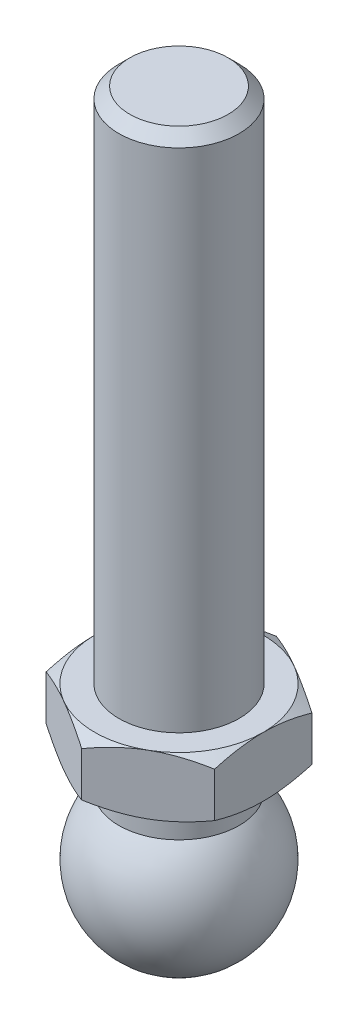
ISO-10303-21;
HEADER;
FILE_DESCRIPTION(('STEP AP214'),'2;1');
FILE_NAME('part.step','',(''),(''),'','','');
FILE_SCHEMA(('AUTOMOTIVE_DESIGN { 1 0 10303 214 1 1 1 1 }'));
ENDSEC;
DATA;
#1=APPLICATION_CONTEXT('core data for automotive mechanical design processes');
#2=APPLICATION_PROTOCOL_DEFINITION('international standard','automotive_design',2000,#1);
#3=PRODUCT_CONTEXT('',#1,'mechanical');
#4=PRODUCT('Part','Part','',(#3));
#5=PRODUCT_RELATED_PRODUCT_CATEGORY('part','',(#4));
#6=PRODUCT_DEFINITION_FORMATION('','',#4);
#7=PRODUCT_DEFINITION_CONTEXT('part definition',#1,'design');
#8=PRODUCT_DEFINITION('design','',#6,#7);
#9=PRODUCT_DEFINITION_SHAPE('','',#8);
#10=(LENGTH_UNIT() NAMED_UNIT(*) SI_UNIT(.MILLI.,.METRE.));
#11=(NAMED_UNIT(*) PLANE_ANGLE_UNIT() SI_UNIT($,.RADIAN.));
#12=(NAMED_UNIT(*) SI_UNIT($,.STERADIAN.) SOLID_ANGLE_UNIT());
#13=UNCERTAINTY_MEASURE_WITH_UNIT(LENGTH_MEASURE(1.E-05),#10,'distance_accuracy_value','');
#14=(GEOMETRIC_REPRESENTATION_CONTEXT(3) GLOBAL_UNCERTAINTY_ASSIGNED_CONTEXT((#13)) GLOBAL_UNIT_ASSIGNED_CONTEXT((#10,
#11,#12)) REPRESENTATION_CONTEXT('',''));
#15=CARTESIAN_POINT('',(0.,0.,0.));
#16=DIRECTION('',(0.,0.,1.));
#17=DIRECTION('',(1.,0.,0.));
#18=AXIS2_PLACEMENT_3D('',#15,#16,#17);
#19=CARTESIAN_POINT('',(0.,12.6,0.));
#20=DIRECTION('',(0.,-1.,0.));
#21=DIRECTION('',(0.,0.,-1.));
#22=AXIS2_PLACEMENT_3D('',#19,#20,#21);
#23=CONICAL_SURFACE('',#22,7.,1.0471975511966);
#24=CARTESIAN_POINT('',(-7.,8.53828268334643,12.1648696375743));
#25=CARTESIAN_POINT('',(-7.,8.68391573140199,11.8738003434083));
#26=CARTESIAN_POINT('',(-7.,8.82854589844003,11.5822239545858));
#27=CARTESIAN_POINT('',(-7.,9.11531569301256,10.997825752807));
#28=CARTESIAN_POINT('',(-7.,9.25745515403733,10.7050038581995));
#29=CARTESIAN_POINT('',(-7.,9.53902214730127,10.117331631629));
#30=CARTESIAN_POINT('',(-7.,9.67844364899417,9.8224784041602));
#31=CARTESIAN_POINT('',(-7.,9.95360604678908,9.23106328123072));
#32=CARTESIAN_POINT('',(-7.,10.0893470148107,8.93450141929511));
#33=CARTESIAN_POINT('',(-7.,10.3623110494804,8.32593520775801));
#34=CARTESIAN_POINT('',(-7.,10.4993254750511,8.0138369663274));
#35=CARTESIAN_POINT('',(-7.,10.7671383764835,7.38695797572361));
#36=CARTESIAN_POINT('',(-7.,10.8979365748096,7.07217710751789));
#37=CARTESIAN_POINT('',(-7.,11.1515530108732,6.43962449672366));
#38=CARTESIAN_POINT('',(-7.,11.274376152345,6.12185473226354));
#39=CARTESIAN_POINT('',(-7.,11.5099016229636,5.4826031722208));
#40=CARTESIAN_POINT('',(-7.,11.6226050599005,5.16112178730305));
#41=CARTESIAN_POINT('',(-7.,11.8599014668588,4.43821731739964));
#42=CARTESIAN_POINT('',(-7.,11.981118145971,4.03566892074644));
#43=CARTESIAN_POINT('',(-7.,12.1969740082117,3.22331060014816));
#44=CARTESIAN_POINT('',(-7.,12.2916155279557,2.81350131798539));
#45=CARTESIAN_POINT('',(-7.,12.4069999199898,2.1974256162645));
#46=CARTESIAN_POINT('',(-7.,12.4408518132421,1.99359214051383));
#47=CARTESIAN_POINT('',(-7.,12.4993191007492,1.58461613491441));
#48=CARTESIAN_POINT('',(-7.,12.5239358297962,1.37947379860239));
#49=CARTESIAN_POINT('',(-7.,12.5631968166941,0.968289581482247));
#50=CARTESIAN_POINT('',(-7.,12.5778439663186,0.762247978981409));
#51=CARTESIAN_POINT('',(-7.,12.5967021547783,0.349683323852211));
#52=CARTESIAN_POINT('',(-7.,12.6009132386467,0.143160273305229));
#53=CARTESIAN_POINT('',(-7.,12.5987493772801,-0.271082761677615));
#54=CARTESIAN_POINT('',(-7.,12.5923100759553,-0.47880240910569));
#55=CARTESIAN_POINT('',(-7.,12.5689433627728,-0.893645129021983));
#56=CARTESIAN_POINT('',(-7.,12.5520159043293,-1.10076819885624));
#57=CARTESIAN_POINT('',(-7.,12.5082124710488,-1.5140304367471));
#58=CARTESIAN_POINT('',(-7.,12.4813327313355,-1.72016920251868));
#59=CARTESIAN_POINT('',(-7.,12.4184180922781,-2.13103319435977));
#60=CARTESIAN_POINT('',(-7.,12.3823828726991,-2.33575837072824));
#61=CARTESIAN_POINT('',(-7.,12.2605686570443,-2.95437912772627));
#62=CARTESIAN_POINT('',(-7.,12.1618729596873,-3.36575077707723));
#63=CARTESIAN_POINT('',(-7.,11.9384533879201,-4.18138012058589));
#64=CARTESIAN_POINT('',(-7.,11.8137148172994,-4.58563365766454));
#65=CARTESIAN_POINT('',(-7.,11.5733248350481,-5.30320893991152));
#66=CARTESIAN_POINT('',(-7.,11.4612875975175,-5.6177595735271));
#67=CARTESIAN_POINT('',(-7.,11.2278514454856,-6.24325021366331));
#68=CARTESIAN_POINT('',(-7.,11.1064551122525,-6.55419118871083));
#69=CARTESIAN_POINT('',(-7.,10.8562070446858,-7.17328528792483));
#70=CARTESIAN_POINT('',(-7.,10.7273503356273,-7.48143638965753));
#71=CARTESIAN_POINT('',(-7.,10.4637823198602,-8.09523802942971));
#72=CARTESIAN_POINT('',(-7.,10.3290706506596,-8.40088841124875));
#73=CARTESIAN_POINT('',(-7.,10.0607840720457,-8.99716345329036));
#74=CARTESIAN_POINT('',(-7.,9.92740317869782,-9.2878756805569));
#75=CARTESIAN_POINT('',(-7.,9.65714715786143,-9.86766295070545));
#76=CARTESIAN_POINT('',(-7.,9.52027208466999,-10.1567380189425));
#77=CARTESIAN_POINT('',(-7.,9.24389786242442,-10.7329937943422));
#78=CARTESIAN_POINT('',(-7.,9.10440383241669,-11.0201769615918));
#79=CARTESIAN_POINT('',(-7.,8.82302286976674,-11.5933594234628));
#80=CARTESIAN_POINT('',(-7.,8.68113600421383,-11.879358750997));
#81=CARTESIAN_POINT('',(-7.,8.53828268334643,-12.1648696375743));
#82=B_SPLINE_CURVE_WITH_KNOTS('',3,(#24,#25,#26,#27,#28,#29,#30,#31,#32,#33,#34,#35,#36,#37,#38,
#39,#40,#41,#42,#43,#44,#45,#46,#47,#48,#49,#50,#51,#52,#53,#54,#55,#56,#57,#58,#59,#60,#61,#62,
#63,#64,#65,#66,#67,#68,#69,#70,#71,#72,#73,#74,#75,#76,#77,#78,#79,#80,#81),.UNSPECIFIED.,.F.,
.F.,(4,2,2,2,2,2,2,2,2,2,2,2,2,2,2,2,2,2,2,2,2,2,2,2,2,2,2,2,4),(0.,0.976413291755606,
1.95289161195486,2.93133423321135,3.90975772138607,4.93225217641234,5.95479223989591,
6.97669748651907,7.99849072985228,9.25906449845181,10.5195273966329,11.1392271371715,
11.7588372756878,12.3782676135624,12.9976952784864,13.6208795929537,14.2440666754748,
14.8674897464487,15.490934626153,16.7587972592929,18.027377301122,19.0289263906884,
20.0302002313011,21.0321496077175,22.0341611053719,22.9936838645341,23.9531917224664,
24.9109871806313,25.8687558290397),.UNSPECIFIED.);
#83=CARTESIAN_POINT('',(-7.,11.9747852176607,4.04145188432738));
#84=VERTEX_POINT('',#83);
#85=CARTESIAN_POINT('',(-7.,12.6,0.));
#86=VERTEX_POINT('',#85);
#87=EDGE_CURVE('E309',#84,#86,#82,.T.);
#88=ORIENTED_EDGE('',*,*,#87,.F.);
#89=CARTESIAN_POINT('',(0.0002,11.9747185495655,8.0830192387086));
#90=CARTESIAN_POINT('',(-0.153667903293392,12.0260001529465,7.99418356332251));
#91=CARTESIAN_POINT('',(-0.30810950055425,12.0749544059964,7.90501666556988));
#92=CARTESIAN_POINT('',(-0.618246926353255,12.1675672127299,7.72595873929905));
#93=CARTESIAN_POINT('',(-0.773943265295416,12.2112234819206,7.63606741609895));
#94=CARTESIAN_POINT('',(-1.24352516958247,12.3333884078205,7.36495417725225));
#95=CARTESIAN_POINT('',(-1.5592643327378,12.402874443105,7.18266208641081));
#96=CARTESIAN_POINT('',(-2.03176224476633,12.4843550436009,6.9098652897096));
#97=CARTESIAN_POINT('',(-2.18710922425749,12.5075665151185,6.82017566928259));
#98=CARTESIAN_POINT('',(-2.49850511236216,12.5464887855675,6.64039116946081));
#99=CARTESIAN_POINT('',(-2.65455395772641,12.5622002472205,6.55029632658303));
#100=CARTESIAN_POINT('',(-2.96692267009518,12.5857220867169,6.36995016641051));
#101=CARTESIAN_POINT('',(-3.12324202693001,12.5935414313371,6.27969914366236));
#102=CARTESIAN_POINT('',(-3.43601650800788,12.6011197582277,6.09911871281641));
#103=CARTESIAN_POINT('',(-3.59247162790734,12.600878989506,6.00878930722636));
#104=CARTESIAN_POINT('',(-4.02110687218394,12.5891402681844,5.76131663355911));
#105=CARTESIAN_POINT('',(-4.2931466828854,12.5694342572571,5.60425437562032));
#106=CARTESIAN_POINT('',(-4.8354194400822,12.5069465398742,5.29117305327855));
#107=CARTESIAN_POINT('',(-5.10565047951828,12.464143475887,5.13515508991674));
#108=CARTESIAN_POINT('',(-5.64901454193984,12.3571483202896,4.82144370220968));
#109=CARTESIAN_POINT('',(-5.92207900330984,12.2925029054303,4.66378986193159));
#110=CARTESIAN_POINT('',(-6.46413578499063,12.145783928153,4.35083323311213));
#111=CARTESIAN_POINT('',(-6.73313504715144,12.0637448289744,4.19552643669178));
#112=CARTESIAN_POINT('',(-7.0002,11.9747185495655,4.04133641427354));
#113=B_SPLINE_CURVE_WITH_KNOTS('',3,(#89,#90,#91,#92,#93,#94,#95,#96,#97,#98,#99,#100,#101,#102,
#103,#104,#105,#106,#107,#108,#109,#110,#111,#112),.UNSPECIFIED.,.F.,.F.,(4,2,2,2,2,2,2,2,2,2,2,
4),(0.,0.554727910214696,1.10969417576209,2.2219327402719,2.76443041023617,3.30688013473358,
3.8487128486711,4.3905288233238,5.33376515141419,6.27787517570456,7.2429241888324,
8.20607866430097),.UNSPECIFIED.);
#114=CARTESIAN_POINT('',(-3.5,12.6,6.06217782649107));
#115=VERTEX_POINT('',#114);
#116=EDGE_CURVE('E135',#115,#84,#113,.T.);
#117=ORIENTED_EDGE('',*,*,#116,.F.);
#118=CARTESIAN_POINT('',(0.,12.6,0.));
#119=DIRECTION('',(0.,-1.,0.));
#120=DIRECTION('',(0.,0.,-1.));
#121=AXIS2_PLACEMENT_3D('',#118,#119,#120);
#122=CIRCLE('',#121,7.);
#123=EDGE_CURVE('E283',#115,#86,#122,.T.);
#124=ORIENTED_EDGE('',*,*,#123,.T.);
#125=EDGE_LOOP('',(#88,#117,#124));
#126=FACE_BOUND('',#125,.T.);
#127=ADVANCED_FACE('F14',(#126),#23,.T.);
#128=CARTESIAN_POINT('',(-7.,11.9747852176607,-4.04145188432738));
#129=VERTEX_POINT('',#128);
#130=EDGE_CURVE('E193',#86,#129,#82,.T.);
#131=ORIENTED_EDGE('',*,*,#130,.F.);
#132=CARTESIAN_POINT('',(-3.5,12.6,-6.06217782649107));
#133=VERTEX_POINT('',#132);
#134=EDGE_CURVE('E195',#86,#133,#122,.T.);
#135=ORIENTED_EDGE('',*,*,#134,.T.);
#136=CARTESIAN_POINT('',(-7.0002,11.9747185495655,-4.04133641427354));
#137=CARTESIAN_POINT('',(-6.84633209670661,12.0260001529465,-4.13017208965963));
#138=CARTESIAN_POINT('',(-6.69189049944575,12.0749544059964,-4.21933898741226));
#139=CARTESIAN_POINT('',(-6.38175307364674,12.1675672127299,-4.39839691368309));
#140=CARTESIAN_POINT('',(-6.22605673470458,12.2112234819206,-4.48828823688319));
#141=CARTESIAN_POINT('',(-5.75647483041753,12.3333884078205,-4.75940147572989));
#142=CARTESIAN_POINT('',(-5.4407356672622,12.402874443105,-4.94169356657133));
#143=CARTESIAN_POINT('',(-4.96823775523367,12.4843550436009,-5.21449036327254));
#144=CARTESIAN_POINT('',(-4.81289077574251,12.5075665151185,-5.30417998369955));
#145=CARTESIAN_POINT('',(-4.50149488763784,12.5464887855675,-5.48396448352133));
#146=CARTESIAN_POINT('',(-4.34544604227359,12.5622002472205,-5.57405932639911));
#147=CARTESIAN_POINT('',(-4.03307732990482,12.5857220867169,-5.75440548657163));
#148=CARTESIAN_POINT('',(-3.87675797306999,12.5935414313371,-5.84465650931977));
#149=CARTESIAN_POINT('',(-3.56398349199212,12.6011197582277,-6.02523694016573));
#150=CARTESIAN_POINT('',(-3.40752837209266,12.600878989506,-6.11556634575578));
#151=CARTESIAN_POINT('',(-2.97889312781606,12.5891402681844,-6.36303901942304));
#152=CARTESIAN_POINT('',(-2.7068533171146,12.5694342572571,-6.52010127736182));
#153=CARTESIAN_POINT('',(-2.1645805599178,12.5069465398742,-6.83318259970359));
#154=CARTESIAN_POINT('',(-1.89434952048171,12.464143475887,-6.9892005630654));
#155=CARTESIAN_POINT('',(-1.35098545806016,12.3571483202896,-7.30291195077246));
#156=CARTESIAN_POINT('',(-1.07792099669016,12.2925029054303,-7.46056579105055));
#157=CARTESIAN_POINT('',(-0.535864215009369,12.145783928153,-7.77352241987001));
#158=CARTESIAN_POINT('',(-0.266864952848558,12.0637448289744,-7.92882921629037));
#159=CARTESIAN_POINT('',(0.000200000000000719,11.9747185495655,-8.0830192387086));
#160=B_SPLINE_CURVE_WITH_KNOTS('',3,(#136,#137,#138,#139,#140,#141,#142,#143,#144,#145,#146,
#147,#148,#149,#150,#151,#152,#153,#154,#155,#156,#157,#158,#159),.UNSPECIFIED.,.F.,.F.,(4,2,2,
2,2,2,2,2,2,2,2,4),(0.,0.554727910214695,1.10969417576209,2.2219327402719,2.76443041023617,
3.30688013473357,3.8487128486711,4.39052882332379,5.33376515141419,6.27787517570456,
7.2429241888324,8.20607866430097),.UNSPECIFIED.);
#161=EDGE_CURVE('E183',#129,#133,#160,.T.);
#162=ORIENTED_EDGE('',*,*,#161,.F.);
#163=EDGE_LOOP('',(#131,#135,#162));
#164=FACE_BOUND('',#163,.T.);
#165=ADVANCED_FACE('F192',(#164),#23,.T.);
#166=CARTESIAN_POINT('',(0.,11.9747852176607,-8.08290376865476));
#167=VERTEX_POINT('',#166);
#168=EDGE_CURVE('E197',#133,#167,#160,.T.);
#169=ORIENTED_EDGE('',*,*,#168,.F.);
#170=CARTESIAN_POINT('',(3.5,12.6,-6.06217782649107));
#171=VERTEX_POINT('',#170);
#172=EDGE_CURVE('E293',#133,#171,#122,.T.);
#173=ORIENTED_EDGE('',*,*,#172,.T.);
#174=CARTESIAN_POINT('',(-0.0002,11.9747185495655,-8.0830192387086));
#175=CARTESIAN_POINT('',(0.153667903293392,12.0260001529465,-7.99418356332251));
#176=CARTESIAN_POINT('',(0.30810950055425,12.0749544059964,-7.90501666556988));
#177=CARTESIAN_POINT('',(0.618246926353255,12.1675672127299,-7.72595873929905));
#178=CARTESIAN_POINT('',(0.773943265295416,12.2112234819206,-7.63606741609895));
#179=CARTESIAN_POINT('',(1.24352516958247,12.3333884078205,-7.36495417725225));
#180=CARTESIAN_POINT('',(1.5592643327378,12.402874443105,-7.18266208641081));
#181=CARTESIAN_POINT('',(2.03176224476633,12.4843550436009,-6.9098652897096));
#182=CARTESIAN_POINT('',(2.18710922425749,12.5075665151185,-6.82017566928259));
#183=CARTESIAN_POINT('',(2.49850511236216,12.5464887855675,-6.64039116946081));
#184=CARTESIAN_POINT('',(2.65455395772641,12.5622002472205,-6.55029632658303));
#185=CARTESIAN_POINT('',(2.96692267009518,12.5857220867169,-6.36995016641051));
#186=CARTESIAN_POINT('',(3.12324202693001,12.5935414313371,-6.27969914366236));
#187=CARTESIAN_POINT('',(3.43601650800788,12.6011197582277,-6.09911871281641));
#188=CARTESIAN_POINT('',(3.59247162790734,12.600878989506,-6.00878930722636));
#189=CARTESIAN_POINT('',(4.02110687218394,12.5891402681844,-5.76131663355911));
#190=CARTESIAN_POINT('',(4.2931466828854,12.5694342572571,-5.60425437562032));
#191=CARTESIAN_POINT('',(4.8354194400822,12.5069465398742,-5.29117305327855));
#192=CARTESIAN_POINT('',(5.10565047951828,12.464143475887,-5.13515508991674));
#193=CARTESIAN_POINT('',(5.64901454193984,12.3571483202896,-4.82144370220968));
#194=CARTESIAN_POINT('',(5.92207900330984,12.2925029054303,-4.66378986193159));
#195=CARTESIAN_POINT('',(6.46413578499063,12.145783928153,-4.35083323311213));
#196=CARTESIAN_POINT('',(6.73313504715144,12.0637448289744,-4.19552643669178));
#197=CARTESIAN_POINT('',(7.0002,11.9747185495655,-4.04133641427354));
#198=B_SPLINE_CURVE_WITH_KNOTS('',3,(#174,#175,#176,#177,#178,#179,#180,#181,#182,#183,#184,
#185,#186,#187,#188,#189,#190,#191,#192,#193,#194,#195,#196,#197),.UNSPECIFIED.,.F.,.F.,(4,2,2,
2,2,2,2,2,2,2,2,4),(0.,0.554727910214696,1.10969417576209,2.2219327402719,2.76443041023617,
3.30688013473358,3.8487128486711,4.3905288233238,5.33376515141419,6.27787517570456,
7.2429241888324,8.20607866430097),.UNSPECIFIED.);
#199=EDGE_CURVE('E243',#167,#171,#198,.T.);
#200=ORIENTED_EDGE('',*,*,#199,.F.);
#201=EDGE_LOOP('',(#169,#173,#200));
#202=FACE_BOUND('',#201,.T.);
#203=ADVANCED_FACE('F342',(#202),#23,.T.);
#204=CARTESIAN_POINT('',(7.,11.9747852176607,-4.04145188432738));
#205=VERTEX_POINT('',#204);
#206=EDGE_CURVE('E238',#171,#205,#198,.T.);
#207=ORIENTED_EDGE('',*,*,#206,.F.);
#208=CARTESIAN_POINT('',(7.,12.6,0.));
#209=VERTEX_POINT('',#208);
#210=EDGE_CURVE('E288',#171,#209,#122,.T.);
#211=ORIENTED_EDGE('',*,*,#210,.T.);
#212=CARTESIAN_POINT('',(7.,8.53828268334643,-12.1648696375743));
#213=CARTESIAN_POINT('',(7.,8.68391573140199,-11.8738003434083));
#214=CARTESIAN_POINT('',(7.,8.82854589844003,-11.5822239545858));
#215=CARTESIAN_POINT('',(7.,9.11531569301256,-10.997825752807));
#216=CARTESIAN_POINT('',(7.,9.25745515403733,-10.7050038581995));
#217=CARTESIAN_POINT('',(7.,9.53902214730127,-10.117331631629));
#218=CARTESIAN_POINT('',(7.,9.67844364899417,-9.8224784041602));
#219=CARTESIAN_POINT('',(7.,9.95360604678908,-9.23106328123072));
#220=CARTESIAN_POINT('',(7.,10.0893470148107,-8.93450141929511));
#221=CARTESIAN_POINT('',(7.,10.3623110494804,-8.32593520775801));
#222=CARTESIAN_POINT('',(7.,10.4993254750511,-8.0138369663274));
#223=CARTESIAN_POINT('',(7.,10.7671383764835,-7.38695797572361));
#224=CARTESIAN_POINT('',(7.,10.8979365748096,-7.07217710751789));
#225=CARTESIAN_POINT('',(7.,11.1515530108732,-6.43962449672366));
#226=CARTESIAN_POINT('',(7.,11.274376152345,-6.12185473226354));
#227=CARTESIAN_POINT('',(7.,11.5099016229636,-5.4826031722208));
#228=CARTESIAN_POINT('',(7.,11.6226050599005,-5.16112178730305));
#229=CARTESIAN_POINT('',(7.,11.8599014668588,-4.43821731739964));
#230=CARTESIAN_POINT('',(7.,11.981118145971,-4.03566892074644));
#231=CARTESIAN_POINT('',(7.,12.1969740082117,-3.22331060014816));
#232=CARTESIAN_POINT('',(7.,12.2916155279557,-2.81350131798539));
#233=CARTESIAN_POINT('',(7.,12.4069999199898,-2.1974256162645));
#234=CARTESIAN_POINT('',(7.,12.4408518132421,-1.99359214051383));
#235=CARTESIAN_POINT('',(7.,12.4993191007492,-1.58461613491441));
#236=CARTESIAN_POINT('',(7.,12.5239358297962,-1.37947379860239));
#237=CARTESIAN_POINT('',(7.,12.5631968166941,-0.968289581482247));
#238=CARTESIAN_POINT('',(7.,12.5778439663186,-0.762247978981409));
#239=CARTESIAN_POINT('',(7.,12.5967021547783,-0.349683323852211));
#240=CARTESIAN_POINT('',(7.,12.6009132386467,-0.143160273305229));
#241=CARTESIAN_POINT('',(7.,12.5987493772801,0.271082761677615));
#242=CARTESIAN_POINT('',(7.,12.5923100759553,0.47880240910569));
#243=CARTESIAN_POINT('',(7.,12.5689433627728,0.893645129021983));
#244=CARTESIAN_POINT('',(7.,12.5520159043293,1.10076819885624));
#245=CARTESIAN_POINT('',(7.,12.5082124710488,1.5140304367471));
#246=CARTESIAN_POINT('',(7.,12.4813327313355,1.72016920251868));
#247=CARTESIAN_POINT('',(7.,12.4184180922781,2.13103319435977));
#248=CARTESIAN_POINT('',(7.,12.3823828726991,2.33575837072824));
#249=CARTESIAN_POINT('',(7.,12.2605686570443,2.95437912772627));
#250=CARTESIAN_POINT('',(7.,12.1618729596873,3.36575077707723));
#251=CARTESIAN_POINT('',(7.,11.9384533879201,4.18138012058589));
#252=CARTESIAN_POINT('',(7.,11.8137148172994,4.58563365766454));
#253=CARTESIAN_POINT('',(7.,11.5733248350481,5.30320893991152));
#254=CARTESIAN_POINT('',(7.,11.4612875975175,5.6177595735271));
#255=CARTESIAN_POINT('',(7.,11.2278514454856,6.24325021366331));
#256=CARTESIAN_POINT('',(7.,11.1064551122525,6.55419118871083));
#257=CARTESIAN_POINT('',(7.,10.8562070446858,7.17328528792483));
#258=CARTESIAN_POINT('',(7.,10.7273503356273,7.48143638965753));
#259=CARTESIAN_POINT('',(7.,10.4637823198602,8.09523802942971));
#260=CARTESIAN_POINT('',(7.,10.3290706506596,8.40088841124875));
#261=CARTESIAN_POINT('',(7.,10.0607840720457,8.99716345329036));
#262=CARTESIAN_POINT('',(7.,9.92740317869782,9.2878756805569));
#263=CARTESIAN_POINT('',(7.,9.65714715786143,9.86766295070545));
#264=CARTESIAN_POINT('',(7.,9.52027208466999,10.1567380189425));
#265=CARTESIAN_POINT('',(7.,9.24389786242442,10.7329937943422));
#266=CARTESIAN_POINT('',(7.,9.10440383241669,11.0201769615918));
#267=CARTESIAN_POINT('',(7.,8.82302286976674,11.5933594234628));
#268=CARTESIAN_POINT('',(7.,8.68113600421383,11.879358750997));
#269=CARTESIAN_POINT('',(7.,8.53828268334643,12.1648696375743));
#270=B_SPLINE_CURVE_WITH_KNOTS('',3,(#212,#213,#214,#215,#216,#217,#218,#219,#220,#221,#222,
#223,#224,#225,#226,#227,#228,#229,#230,#231,#232,#233,#234,#235,#236,#237,#238,#239,#240,#241,
#242,#243,#244,#245,#246,#247,#248,#249,#250,#251,#252,#253,#254,#255,#256,#257,#258,#259,#260,
#261,#262,#263,#264,#265,#266,#267,#268,#269),.UNSPECIFIED.,.F.,.F.,(4,2,2,2,2,2,2,2,2,2,2,2,2,
2,2,2,2,2,2,2,2,2,2,2,2,2,2,2,4),(0.,0.976413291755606,1.95289161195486,2.93133423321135,
3.90975772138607,4.93225217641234,5.95479223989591,6.97669748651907,7.99849072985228,
9.25906449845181,10.5195273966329,11.1392271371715,11.7588372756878,12.3782676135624,
12.9976952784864,13.6208795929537,14.2440666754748,14.8674897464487,15.490934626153,
16.7587972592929,18.027377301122,19.0289263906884,20.0302002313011,21.0321496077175,
22.0341611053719,22.9936838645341,23.9531917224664,24.9109871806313,25.8687558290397),.UNSPECIFIED.);
#271=EDGE_CURVE('E249',#205,#209,#270,.T.);
#272=ORIENTED_EDGE('',*,*,#271,.F.);
#273=EDGE_LOOP('',(#207,#211,#272));
#274=FACE_BOUND('',#273,.T.);
#275=ADVANCED_FACE('F352',(#274),#23,.T.);
#276=CARTESIAN_POINT('',(7.,11.9747852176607,4.04145188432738));
#277=VERTEX_POINT('',#276);
#278=EDGE_CURVE('E251',#209,#277,#270,.T.);
#279=ORIENTED_EDGE('',*,*,#278,.F.);
#280=CARTESIAN_POINT('',(3.5,12.6,6.06217782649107));
#281=VERTEX_POINT('',#280);
#282=EDGE_CURVE('E281',#209,#281,#122,.T.);
#283=ORIENTED_EDGE('',*,*,#282,.T.);
#284=CARTESIAN_POINT('',(7.0002,11.9747185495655,4.04133641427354));
#285=CARTESIAN_POINT('',(6.84633209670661,12.0260001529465,4.13017208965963));
#286=CARTESIAN_POINT('',(6.69189049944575,12.0749544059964,4.21933898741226));
#287=CARTESIAN_POINT('',(6.38175307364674,12.1675672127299,4.39839691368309));
#288=CARTESIAN_POINT('',(6.22605673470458,12.2112234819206,4.48828823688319));
#289=CARTESIAN_POINT('',(5.75647483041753,12.3333884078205,4.75940147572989));
#290=CARTESIAN_POINT('',(5.4407356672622,12.402874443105,4.94169356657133));
#291=CARTESIAN_POINT('',(4.96823775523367,12.4843550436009,5.21449036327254));
#292=CARTESIAN_POINT('',(4.81289077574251,12.5075665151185,5.30417998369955));
#293=CARTESIAN_POINT('',(4.50149488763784,12.5464887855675,5.48396448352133));
#294=CARTESIAN_POINT('',(4.34544604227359,12.5622002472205,5.57405932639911));
#295=CARTESIAN_POINT('',(4.03307732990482,12.5857220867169,5.75440548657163));
#296=CARTESIAN_POINT('',(3.87675797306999,12.5935414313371,5.84465650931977));
#297=CARTESIAN_POINT('',(3.56398349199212,12.6011197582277,6.02523694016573));
#298=CARTESIAN_POINT('',(3.40752837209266,12.600878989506,6.11556634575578));
#299=CARTESIAN_POINT('',(2.97889312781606,12.5891402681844,6.36303901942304));
#300=CARTESIAN_POINT('',(2.7068533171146,12.5694342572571,6.52010127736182));
#301=CARTESIAN_POINT('',(2.1645805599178,12.5069465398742,6.83318259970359));
#302=CARTESIAN_POINT('',(1.89434952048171,12.464143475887,6.9892005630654));
#303=CARTESIAN_POINT('',(1.35098545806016,12.3571483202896,7.30291195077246));
#304=CARTESIAN_POINT('',(1.07792099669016,12.2925029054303,7.46056579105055));
#305=CARTESIAN_POINT('',(0.535864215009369,12.145783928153,7.77352241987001));
#306=CARTESIAN_POINT('',(0.266864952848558,12.0637448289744,7.92882921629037));
#307=CARTESIAN_POINT('',(-0.000200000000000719,11.9747185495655,8.0830192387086));
#308=B_SPLINE_CURVE_WITH_KNOTS('',3,(#284,#285,#286,#287,#288,#289,#290,#291,#292,#293,#294,
#295,#296,#297,#298,#299,#300,#301,#302,#303,#304,#305,#306,#307),.UNSPECIFIED.,.F.,.F.,(4,2,2,
2,2,2,2,2,2,2,2,4),(0.,0.554727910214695,1.10969417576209,2.2219327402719,2.76443041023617,
3.30688013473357,3.8487128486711,4.39052882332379,5.33376515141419,6.27787517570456,
7.2429241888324,8.20607866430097),.UNSPECIFIED.);
#309=EDGE_CURVE('E126',#277,#281,#308,.T.);
#310=ORIENTED_EDGE('',*,*,#309,.F.);
#311=EDGE_LOOP('',(#279,#283,#310));
#312=FACE_BOUND('',#311,.T.);
#313=ADVANCED_FACE('F285',(#312),#23,.T.);
#314=CARTESIAN_POINT('',(0.,11.9747852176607,8.08290376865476));
#315=VERTEX_POINT('',#314);
#316=EDGE_CURVE('E116',#281,#315,#308,.T.);
#317=ORIENTED_EDGE('',*,*,#316,.F.);
#318=EDGE_CURVE('E274',#281,#115,#122,.T.);
#319=ORIENTED_EDGE('',*,*,#318,.T.);
#320=EDGE_CURVE('E29',#315,#115,#113,.T.);
#321=ORIENTED_EDGE('',*,*,#320,.F.);
#322=EDGE_LOOP('',(#317,#319,#321));
#323=FACE_BOUND('',#322,.T.);
#324=ADVANCED_FACE('F273',(#323),#23,.T.);
#325=CARTESIAN_POINT('',(0.,55.6,0.));
#326=DIRECTION('',(0.,-1.,0.));
#327=DIRECTION('',(0.,0.,-1.));
#328=AXIS2_PLACEMENT_3D('',#325,#326,#327);
#329=PLANE('',#328);
#330=CARTESIAN_POINT('',(0.,55.6,0.));
#331=DIRECTION('',(0.,-1.,0.));
#332=DIRECTION('',(0.,0.,-1.));
#333=AXIS2_PLACEMENT_3D('',#330,#331,#332);
#334=CIRCLE('',#333,4.08);
#335=CARTESIAN_POINT('',(0.,55.6,-4.08));
#336=VERTEX_POINT('',#335);
#337=EDGE_CURVE('E22',#336,#336,#334,.T.);
#338=ORIENTED_EDGE('',*,*,#337,.F.);
#339=EDGE_LOOP('',(#338));
#340=FACE_BOUND('',#339,.T.);
#341=ADVANCED_FACE('F16',(#340),#329,.F.);
#342=CARTESIAN_POINT('',(0.,55.6,0.));
#343=DIRECTION('',(0.,-1.,0.));
#344=DIRECTION('',(0.,0.,-1.));
#345=AXIS2_PLACEMENT_3D('',#342,#343,#344);
#346=CONICAL_SURFACE('',#345,4.08,0.785398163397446);
#347=CARTESIAN_POINT('',(0.,54.68,0.));
#348=DIRECTION('',(0.,-1.,0.));
#349=DIRECTION('',(0.,0.,-1.));
#350=AXIS2_PLACEMENT_3D('',#347,#348,#349);
#351=CIRCLE('',#350,5.);
#352=CARTESIAN_POINT('',(0.,54.68,-5.));
#353=VERTEX_POINT('',#352);
#354=EDGE_CURVE('E290',#353,#353,#351,.T.);
#355=ORIENTED_EDGE('',*,*,#354,.F.);
#356=EDGE_LOOP('',(#355));
#357=FACE_BOUND('',#356,.T.);
#358=ORIENTED_EDGE('',*,*,#337,.T.);
#359=EDGE_LOOP('',(#358));
#360=FACE_BOUND('',#359,.T.);
#361=ADVANCED_FACE('F350',(#357,#360),#346,.T.);
#362=CARTESIAN_POINT('',(0.,-7.,0.));
#363=DIRECTION('',(0.,-1.,0.));
#364=DIRECTION('',(0.,0.,-1.));
#365=AXIS2_PLACEMENT_3D('',#362,#363,#364);
#366=CYLINDRICAL_SURFACE('',#365,5.);
#367=CARTESIAN_POINT('',(0.,12.6,0.));
#368=DIRECTION('',(0.,-1.,0.));
#369=DIRECTION('',(0.,0.,-1.));
#370=AXIS2_PLACEMENT_3D('',#367,#368,#369);
#371=CIRCLE('',#370,5.);
#372=CARTESIAN_POINT('',(0.,12.6,-5.));
#373=VERTEX_POINT('',#372);
#374=EDGE_CURVE('E287',#373,#373,#371,.T.);
#375=ORIENTED_EDGE('',*,*,#374,.F.);
#376=EDGE_LOOP('',(#375));
#377=FACE_BOUND('',#376,.T.);
#378=ORIENTED_EDGE('',*,*,#354,.T.);
#379=EDGE_LOOP('',(#378));
#380=FACE_BOUND('',#379,.T.);
#381=ADVANCED_FACE('F427',(#377,#380),#366,.T.);
#382=CARTESIAN_POINT('',(5.,12.6,0.));
#383=DIRECTION('',(0.,-1.,0.));
#384=DIRECTION('',(0.,0.,-1.));
#385=AXIS2_PLACEMENT_3D('',#382,#383,#384);
#386=PLANE('',#385);
#387=ORIENTED_EDGE('',*,*,#282,.F.);
#388=ORIENTED_EDGE('',*,*,#210,.F.);
#389=ORIENTED_EDGE('',*,*,#172,.F.);
#390=ORIENTED_EDGE('',*,*,#134,.F.);
#391=ORIENTED_EDGE('',*,*,#123,.F.);
#392=ORIENTED_EDGE('',*,*,#318,.F.);
#393=EDGE_LOOP('',(#387,#388,#389,#390,#391,#392));
#394=FACE_BOUND('',#393,.T.);
#395=ORIENTED_EDGE('',*,*,#374,.T.);
#396=EDGE_LOOP('',(#395));
#397=FACE_BOUND('',#396,.T.);
#398=ADVANCED_FACE('F278',(#394,#397),#386,.F.);
#399=CARTESIAN_POINT('',(-7.,7.65,-4.04145188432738));
#400=DIRECTION('',(-1.,0.,0.));
#401=DIRECTION('',(0.,0.,1.));
#402=AXIS2_PLACEMENT_3D('',#399,#400,#401);
#403=PLANE('',#402);
#404=ORIENTED_EDGE('',*,*,#87,.T.);
#405=ORIENTED_EDGE('',*,*,#130,.T.);
#406=DIRECTION('',(0.,1.,0.));
#407=VECTOR('',#406,1.);
#408=CARTESIAN_POINT('',(-7.,7.65,-4.04145188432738));
#409=LINE('',#408,#407);
#410=CARTESIAN_POINT('',(-7.,8.27521478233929,-4.04145188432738));
#411=VERTEX_POINT('',#410);
#412=EDGE_CURVE('E109',#411,#129,#409,.T.);
#413=ORIENTED_EDGE('',*,*,#412,.F.);
#414=CARTESIAN_POINT('',(-7.,11.7117173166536,-12.1648696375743));
#415=CARTESIAN_POINT('',(-7.,11.566084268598,-11.8738003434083));
#416=CARTESIAN_POINT('',(-7.,11.42145410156,-11.5822239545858));
#417=CARTESIAN_POINT('',(-7.,11.1346843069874,-10.997825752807));
#418=CARTESIAN_POINT('',(-7.,10.9925448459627,-10.7050038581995));
#419=CARTESIAN_POINT('',(-7.,10.7109778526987,-10.1173316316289));
#420=CARTESIAN_POINT('',(-7.,10.5715563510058,-9.82247840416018));
#421=CARTESIAN_POINT('',(-7.,10.2963939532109,-9.2310632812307));
#422=CARTESIAN_POINT('',(-7.,10.1606529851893,-8.93450141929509));
#423=CARTESIAN_POINT('',(-7.,9.88768895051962,-8.32593520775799));
#424=CARTESIAN_POINT('',(-7.,9.75067452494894,-8.01383696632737));
#425=CARTESIAN_POINT('',(-7.,9.48286162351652,-7.38695797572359));
#426=CARTESIAN_POINT('',(-7.,9.3520634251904,-7.07217710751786));
#427=CARTESIAN_POINT('',(-7.,9.09844698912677,-6.43962449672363));
#428=CARTESIAN_POINT('',(-7.,8.97562384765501,-6.12185473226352));
#429=CARTESIAN_POINT('',(-7.,8.7400983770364,-5.48260317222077));
#430=CARTESIAN_POINT('',(-7.,8.62739494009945,-5.16112178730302));
#431=CARTESIAN_POINT('',(-7.,8.39009853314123,-4.43821731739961));
#432=CARTESIAN_POINT('',(-7.,8.26888185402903,-4.0356689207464));
#433=CARTESIAN_POINT('',(-7.,8.05302599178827,-3.22331060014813));
#434=CARTESIAN_POINT('',(-7.,7.95838447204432,-2.81350131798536));
#435=CARTESIAN_POINT('',(-7.,7.84300008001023,-2.19742561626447));
#436=CARTESIAN_POINT('',(-7.,7.80914818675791,-1.9935921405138));
#437=CARTESIAN_POINT('',(-7.,7.75068089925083,-1.58461613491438));
#438=CARTESIAN_POINT('',(-7.,7.7260641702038,-1.37947379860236));
#439=CARTESIAN_POINT('',(-7.,7.68680318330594,-0.968289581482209));
#440=CARTESIAN_POINT('',(-7.,7.67215603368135,-0.762247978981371));
#441=CARTESIAN_POINT('',(-7.,7.65329784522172,-0.349683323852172));
#442=CARTESIAN_POINT('',(-7.,7.64908676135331,-0.14316027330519));
#443=CARTESIAN_POINT('',(-7.,7.65125062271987,0.271082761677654));
#444=CARTESIAN_POINT('',(-7.,7.65768992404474,0.478802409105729));
#445=CARTESIAN_POINT('',(-7.,7.68105663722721,0.893645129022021));
#446=CARTESIAN_POINT('',(-7.,7.69798409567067,1.10076819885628));
#447=CARTESIAN_POINT('',(-7.,7.74178752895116,1.51403043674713));
#448=CARTESIAN_POINT('',(-7.,7.76866726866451,1.72016920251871));
#449=CARTESIAN_POINT('',(-7.,7.83158190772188,2.13103319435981));
#450=CARTESIAN_POINT('',(-7.,7.86761712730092,2.33575837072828));
#451=CARTESIAN_POINT('',(-7.,7.98943134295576,2.95437912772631));
#452=CARTESIAN_POINT('',(-7.,8.08812704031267,3.36575077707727));
#453=CARTESIAN_POINT('',(-7.,8.31154661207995,4.18138012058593));
#454=CARTESIAN_POINT('',(-7.,8.43628518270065,4.58563365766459));
#455=CARTESIAN_POINT('',(-7.,8.67667516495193,5.30320893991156));
#456=CARTESIAN_POINT('',(-7.,8.78871240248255,5.61775957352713));
#457=CARTESIAN_POINT('',(-7.,9.02214855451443,6.24325021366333));
#458=CARTESIAN_POINT('',(-7.,9.14354488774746,6.55419118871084));
#459=CARTESIAN_POINT('',(-7.,9.39379295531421,7.17328528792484));
#460=CARTESIAN_POINT('',(-7.,9.52264966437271,7.48143638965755));
#461=CARTESIAN_POINT('',(-7.,9.78621768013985,8.09523802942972));
#462=CARTESIAN_POINT('',(-7.,9.92092934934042,8.40088841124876));
#463=CARTESIAN_POINT('',(-7.,10.1892159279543,8.99716345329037));
#464=CARTESIAN_POINT('',(-7.,10.3225968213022,9.28787568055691));
#465=CARTESIAN_POINT('',(-7.,10.5928528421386,9.86766295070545));
#466=CARTESIAN_POINT('',(-7.,10.72972791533,10.1567380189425));
#467=CARTESIAN_POINT('',(-7.,11.0061021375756,10.7329937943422));
#468=CARTESIAN_POINT('',(-7.,11.1455961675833,11.0201769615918));
#469=CARTESIAN_POINT('',(-7.,11.4269771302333,11.5933594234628));
#470=CARTESIAN_POINT('',(-7.,11.5688639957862,11.879358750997));
#471=CARTESIAN_POINT('',(-7.,11.7117173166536,12.1648696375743));
#472=B_SPLINE_CURVE_WITH_KNOTS('',3,(#414,#415,#416,#417,#418,#419,#420,#421,#422,#423,#424,
#425,#426,#427,#428,#429,#430,#431,#432,#433,#434,#435,#436,#437,#438,#439,#440,#441,#442,#443,
#444,#445,#446,#447,#448,#449,#450,#451,#452,#453,#454,#455,#456,#457,#458,#459,#460,#461,#462,
#463,#464,#465,#466,#467,#468,#469,#470,#471),.UNSPECIFIED.,.F.,.F.,(4,2,2,2,2,2,2,2,2,2,2,2,2,
2,2,2,2,2,2,2,2,2,2,2,2,2,2,2,4),(0.,0.976413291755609,1.95289161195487,2.93133423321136,
3.90975772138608,4.93225217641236,5.95479223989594,6.9766974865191,7.99849072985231,
9.25906449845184,10.5195273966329,11.1392271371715,11.7588372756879,12.3782676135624,
12.9976952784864,13.6208795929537,14.2440666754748,14.8674897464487,15.490934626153,
16.758797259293,18.027377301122,19.0289263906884,20.0302002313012,21.0321496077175,
22.0341611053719,22.9936838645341,23.9531917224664,24.9109871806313,25.8687558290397),.UNSPECIFIED.);
#473=CARTESIAN_POINT('',(-7.,7.65,0.));
#474=VERTEX_POINT('',#473);
#475=EDGE_CURVE('E199',#411,#474,#472,.T.);
#476=ORIENTED_EDGE('',*,*,#475,.T.);
#477=CARTESIAN_POINT('',(-7.,8.27521478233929,4.04145188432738));
#478=VERTEX_POINT('',#477);
#479=EDGE_CURVE('E196',#474,#478,#472,.T.);
#480=ORIENTED_EDGE('',*,*,#479,.T.);
#481=DIRECTION('',(0.,1.,0.));
#482=VECTOR('',#481,1.);
#483=CARTESIAN_POINT('',(-7.,7.65,4.04145188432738));
#484=LINE('',#483,#482);
#485=EDGE_CURVE('E118',#478,#84,#484,.T.);
#486=ORIENTED_EDGE('',*,*,#485,.T.);
#487=EDGE_LOOP('',(#404,#405,#413,#476,#480,#486));
#488=FACE_BOUND('',#487,.T.);
#489=ADVANCED_FACE('F224',(#488),#403,.T.);
#490=CARTESIAN_POINT('',(0.,7.65,-8.08290376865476));
#491=DIRECTION('',(-0.5,0.,-0.866025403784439));
#492=DIRECTION('',(-0.866025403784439,0.,0.5));
#493=AXIS2_PLACEMENT_3D('',#490,#491,#492);
#494=PLANE('',#493);
#495=ORIENTED_EDGE('',*,*,#161,.T.);
#496=ORIENTED_EDGE('',*,*,#168,.T.);
#497=DIRECTION('',(0.,1.,0.));
#498=VECTOR('',#497,1.);
#499=CARTESIAN_POINT('',(0.,7.65,-8.08290376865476));
#500=LINE('',#499,#498);
#501=CARTESIAN_POINT('',(0.,8.27521478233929,-8.08290376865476));
#502=VERTEX_POINT('',#501);
#503=EDGE_CURVE('E175',#502,#167,#500,.T.);
#504=ORIENTED_EDGE('',*,*,#503,.F.);
#505=CARTESIAN_POINT('',(0.0002,8.2752814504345,-8.0830192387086));
#506=CARTESIAN_POINT('',(-0.153667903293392,8.22399984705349,-7.99418356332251));
#507=CARTESIAN_POINT('',(-0.30810950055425,8.17504559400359,-7.90501666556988));
#508=CARTESIAN_POINT('',(-0.618246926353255,8.08243278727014,-7.72595873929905));
#509=CARTESIAN_POINT('',(-0.773943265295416,8.03877651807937,-7.63606741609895));
#510=CARTESIAN_POINT('',(-1.24352516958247,7.9166115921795,-7.36495417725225));
#511=CARTESIAN_POINT('',(-1.5592643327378,7.84712555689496,-7.18266208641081));
#512=CARTESIAN_POINT('',(-2.03176224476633,7.7656449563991,-6.9098652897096));
#513=CARTESIAN_POINT('',(-2.18710922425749,7.74243348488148,-6.82017566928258));
#514=CARTESIAN_POINT('',(-2.49850511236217,7.70351121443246,-6.64039116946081));
#515=CARTESIAN_POINT('',(-2.65455395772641,7.68779975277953,-6.55029632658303));
#516=CARTESIAN_POINT('',(-2.96692267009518,7.66427791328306,-6.36995016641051));
#517=CARTESIAN_POINT('',(-3.12324202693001,7.65645856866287,-6.27969914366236));
#518=CARTESIAN_POINT('',(-3.43601650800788,7.64888024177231,-6.09911871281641));
#519=CARTESIAN_POINT('',(-3.59247162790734,7.64912101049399,-6.00878930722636));
#520=CARTESIAN_POINT('',(-4.02110687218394,7.6608597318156,-5.76131663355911));
#521=CARTESIAN_POINT('',(-4.2931466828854,7.68056574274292,-5.60425437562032));
#522=CARTESIAN_POINT('',(-4.8354194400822,7.74305346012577,-5.29117305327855));
#523=CARTESIAN_POINT('',(-5.10565047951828,7.78585652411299,-5.13515508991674));
#524=CARTESIAN_POINT('',(-5.64901454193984,7.89285167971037,-4.82144370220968));
#525=CARTESIAN_POINT('',(-5.92207900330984,7.95749709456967,-4.66378986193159));
#526=CARTESIAN_POINT('',(-6.46413578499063,8.10421607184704,-4.35083323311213));
#527=CARTESIAN_POINT('',(-6.73313504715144,8.18625517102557,-4.19552643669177));
#528=CARTESIAN_POINT('',(-7.0002,8.2752814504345,-4.04133641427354));
#529=B_SPLINE_CURVE_WITH_KNOTS('',3,(#505,#506,#507,#508,#509,#510,#511,#512,#513,#514,#515,
#516,#517,#518,#519,#520,#521,#522,#523,#524,#525,#526,#527,#528),.UNSPECIFIED.,.F.,.F.,(4,2,2,
2,2,2,2,2,2,2,2,4),(0.,0.554727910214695,1.10969417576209,2.2219327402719,2.76443041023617,
3.30688013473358,3.8487128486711,4.39052882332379,5.33376515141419,6.27787517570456,
7.2429241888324,8.20607866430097),.UNSPECIFIED.);
#530=CARTESIAN_POINT('',(-3.5,7.65,-6.06217782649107));
#531=VERTEX_POINT('',#530);
#532=EDGE_CURVE('E201',#502,#531,#529,.T.);
#533=ORIENTED_EDGE('',*,*,#532,.T.);
#534=EDGE_CURVE('E186',#531,#411,#529,.T.);
#535=ORIENTED_EDGE('',*,*,#534,.T.);
#536=ORIENTED_EDGE('',*,*,#412,.T.);
#537=EDGE_LOOP('',(#495,#496,#504,#533,#535,#536));
#538=FACE_BOUND('',#537,.T.);
#539=ADVANCED_FACE('F182',(#538),#494,.T.);
#540=CARTESIAN_POINT('',(7.,7.65,-4.04145188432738));
#541=DIRECTION('',(0.5,0.,-0.866025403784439));
#542=DIRECTION('',(-0.866025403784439,0.,-0.5));
#543=AXIS2_PLACEMENT_3D('',#540,#541,#542);
#544=PLANE('',#543);
#545=ORIENTED_EDGE('',*,*,#199,.T.);
#546=ORIENTED_EDGE('',*,*,#206,.T.);
#547=DIRECTION('',(0.,1.,0.));
#548=VECTOR('',#547,1.);
#549=CARTESIAN_POINT('',(7.,7.65,-4.04145188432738));
#550=LINE('',#549,#548);
#551=CARTESIAN_POINT('',(7.,8.27521478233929,-4.04145188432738));
#552=VERTEX_POINT('',#551);
#553=EDGE_CURVE('E172',#552,#205,#550,.T.);
#554=ORIENTED_EDGE('',*,*,#553,.F.);
#555=CARTESIAN_POINT('',(7.0002,8.2752814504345,-4.04133641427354));
#556=CARTESIAN_POINT('',(6.84633209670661,8.22399984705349,-4.13017208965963));
#557=CARTESIAN_POINT('',(6.69189049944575,8.17504559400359,-4.21933898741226));
#558=CARTESIAN_POINT('',(6.38175307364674,8.08243278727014,-4.39839691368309));
#559=CARTESIAN_POINT('',(6.22605673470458,8.03877651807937,-4.48828823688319));
#560=CARTESIAN_POINT('',(5.75647483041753,7.9166115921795,-4.75940147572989));
#561=CARTESIAN_POINT('',(5.4407356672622,7.84712555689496,-4.94169356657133));
#562=CARTESIAN_POINT('',(4.96823775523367,7.7656449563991,-5.21449036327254));
#563=CARTESIAN_POINT('',(4.81289077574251,7.74243348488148,-5.30417998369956));
#564=CARTESIAN_POINT('',(4.50149488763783,7.70351121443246,-5.48396448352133));
#565=CARTESIAN_POINT('',(4.34544604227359,7.68779975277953,-5.57405932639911));
#566=CARTESIAN_POINT('',(4.03307732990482,7.66427791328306,-5.75440548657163));
#567=CARTESIAN_POINT('',(3.87675797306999,7.65645856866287,-5.84465650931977));
#568=CARTESIAN_POINT('',(3.56398349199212,7.64888024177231,-6.02523694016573));
#569=CARTESIAN_POINT('',(3.40752837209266,7.64912101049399,-6.11556634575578));
#570=CARTESIAN_POINT('',(2.97889312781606,7.6608597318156,-6.36303901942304));
#571=CARTESIAN_POINT('',(2.7068533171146,7.68056574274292,-6.52010127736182));
#572=CARTESIAN_POINT('',(2.1645805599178,7.74305346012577,-6.83318259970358));
#573=CARTESIAN_POINT('',(1.89434952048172,7.78585652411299,-6.9892005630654));
#574=CARTESIAN_POINT('',(1.35098545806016,7.89285167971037,-7.30291195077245));
#575=CARTESIAN_POINT('',(1.07792099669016,7.95749709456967,-7.46056579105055));
#576=CARTESIAN_POINT('',(0.53586421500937,8.10421607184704,-7.77352241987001));
#577=CARTESIAN_POINT('',(0.266864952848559,8.18625517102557,-7.92882921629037));
#578=CARTESIAN_POINT('',(-0.000199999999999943,8.2752814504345,-8.0830192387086));
#579=B_SPLINE_CURVE_WITH_KNOTS('',3,(#555,#556,#557,#558,#559,#560,#561,#562,#563,#564,#565,
#566,#567,#568,#569,#570,#571,#572,#573,#574,#575,#576,#577,#578),.UNSPECIFIED.,.F.,.F.,(4,2,2,
2,2,2,2,2,2,2,2,4),(0.,0.554727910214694,1.10969417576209,2.2219327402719,2.76443041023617,
3.30688013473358,3.8487128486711,4.39052882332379,5.33376515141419,6.27787517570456,
7.2429241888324,8.20607866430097),.UNSPECIFIED.);
#580=CARTESIAN_POINT('',(3.5,7.65,-6.06217782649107));
#581=VERTEX_POINT('',#580);
#582=EDGE_CURVE('E244',#552,#581,#579,.T.);
#583=ORIENTED_EDGE('',*,*,#582,.T.);
#584=EDGE_CURVE('E232',#581,#502,#579,.T.);
#585=ORIENTED_EDGE('',*,*,#584,.T.);
#586=ORIENTED_EDGE('',*,*,#503,.T.);
#587=EDGE_LOOP('',(#545,#546,#554,#583,#585,#586));
#588=FACE_BOUND('',#587,.T.);
#589=ADVANCED_FACE('F223',(#588),#544,.T.);
#590=CARTESIAN_POINT('',(7.,7.65,4.04145188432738));
#591=DIRECTION('',(1.,0.,0.));
#592=DIRECTION('',(0.,0.,-1.));
#593=AXIS2_PLACEMENT_3D('',#590,#591,#592);
#594=PLANE('',#593);
#595=ORIENTED_EDGE('',*,*,#271,.T.);
#596=ORIENTED_EDGE('',*,*,#278,.T.);
#597=DIRECTION('',(0.,1.,0.));
#598=VECTOR('',#597,1.);
#599=CARTESIAN_POINT('',(7.,7.65,4.04145188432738));
#600=LINE('',#599,#598);
#601=CARTESIAN_POINT('',(7.,8.27521478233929,4.04145188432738));
#602=VERTEX_POINT('',#601);
#603=EDGE_CURVE('E117',#602,#277,#600,.T.);
#604=ORIENTED_EDGE('',*,*,#603,.F.);
#605=CARTESIAN_POINT('',(7.,11.7117173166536,12.1648696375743));
#606=CARTESIAN_POINT('',(7.,11.566084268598,11.8738003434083));
#607=CARTESIAN_POINT('',(7.,11.42145410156,11.5822239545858));
#608=CARTESIAN_POINT('',(7.,11.1346843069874,10.997825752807));
#609=CARTESIAN_POINT('',(7.,10.9925448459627,10.7050038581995));
#610=CARTESIAN_POINT('',(7.,10.7109778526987,10.1173316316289));
#611=CARTESIAN_POINT('',(7.,10.5715563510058,9.82247840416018));
#612=CARTESIAN_POINT('',(7.,10.2963939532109,9.2310632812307));
#613=CARTESIAN_POINT('',(7.,10.1606529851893,8.93450141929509));
#614=CARTESIAN_POINT('',(7.,9.88768895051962,8.32593520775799));
#615=CARTESIAN_POINT('',(7.,9.75067452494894,8.01383696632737));
#616=CARTESIAN_POINT('',(7.,9.48286162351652,7.38695797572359));
#617=CARTESIAN_POINT('',(7.,9.3520634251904,7.07217710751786));
#618=CARTESIAN_POINT('',(7.,9.09844698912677,6.43962449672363));
#619=CARTESIAN_POINT('',(7.,8.97562384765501,6.12185473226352));
#620=CARTESIAN_POINT('',(7.,8.7400983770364,5.48260317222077));
#621=CARTESIAN_POINT('',(7.,8.62739494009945,5.16112178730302));
#622=CARTESIAN_POINT('',(7.,8.39009853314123,4.43821731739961));
#623=CARTESIAN_POINT('',(7.,8.26888185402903,4.0356689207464));
#624=CARTESIAN_POINT('',(7.,8.05302599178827,3.22331060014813));
#625=CARTESIAN_POINT('',(7.,7.95838447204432,2.81350131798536));
#626=CARTESIAN_POINT('',(7.,7.84300008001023,2.19742561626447));
#627=CARTESIAN_POINT('',(7.,7.80914818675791,1.9935921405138));
#628=CARTESIAN_POINT('',(7.,7.75068089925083,1.58461613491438));
#629=CARTESIAN_POINT('',(7.,7.7260641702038,1.37947379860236));
#630=CARTESIAN_POINT('',(7.,7.68680318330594,0.968289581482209));
#631=CARTESIAN_POINT('',(7.,7.67215603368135,0.762247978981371));
#632=CARTESIAN_POINT('',(7.,7.65329784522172,0.349683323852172));
#633=CARTESIAN_POINT('',(7.,7.64908676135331,0.14316027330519));
#634=CARTESIAN_POINT('',(7.,7.65125062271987,-0.271082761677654));
#635=CARTESIAN_POINT('',(7.,7.65768992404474,-0.478802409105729));
#636=CARTESIAN_POINT('',(7.,7.68105663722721,-0.893645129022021));
#637=CARTESIAN_POINT('',(7.,7.69798409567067,-1.10076819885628));
#638=CARTESIAN_POINT('',(7.,7.74178752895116,-1.51403043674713));
#639=CARTESIAN_POINT('',(7.,7.76866726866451,-1.72016920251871));
#640=CARTESIAN_POINT('',(7.,7.83158190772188,-2.13103319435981));
#641=CARTESIAN_POINT('',(7.,7.86761712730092,-2.33575837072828));
#642=CARTESIAN_POINT('',(7.,7.98943134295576,-2.95437912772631));
#643=CARTESIAN_POINT('',(7.,8.08812704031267,-3.36575077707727));
#644=CARTESIAN_POINT('',(7.,8.31154661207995,-4.18138012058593));
#645=CARTESIAN_POINT('',(7.,8.43628518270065,-4.58563365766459));
#646=CARTESIAN_POINT('',(7.,8.67667516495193,-5.30320893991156));
#647=CARTESIAN_POINT('',(7.,8.78871240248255,-5.61775957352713));
#648=CARTESIAN_POINT('',(7.,9.02214855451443,-6.24325021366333));
#649=CARTESIAN_POINT('',(7.,9.14354488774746,-6.55419118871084));
#650=CARTESIAN_POINT('',(7.,9.39379295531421,-7.17328528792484));
#651=CARTESIAN_POINT('',(7.,9.52264966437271,-7.48143638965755));
#652=CARTESIAN_POINT('',(7.,9.78621768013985,-8.09523802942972));
#653=CARTESIAN_POINT('',(7.,9.92092934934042,-8.40088841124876));
#654=CARTESIAN_POINT('',(7.,10.1892159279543,-8.99716345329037));
#655=CARTESIAN_POINT('',(7.,10.3225968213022,-9.28787568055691));
#656=CARTESIAN_POINT('',(7.,10.5928528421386,-9.86766295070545));
#657=CARTESIAN_POINT('',(7.,10.72972791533,-10.1567380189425));
#658=CARTESIAN_POINT('',(7.,11.0061021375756,-10.7329937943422));
#659=CARTESIAN_POINT('',(7.,11.1455961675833,-11.0201769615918));
#660=CARTESIAN_POINT('',(7.,11.4269771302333,-11.5933594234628));
#661=CARTESIAN_POINT('',(7.,11.5688639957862,-11.879358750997));
#662=CARTESIAN_POINT('',(7.,11.7117173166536,-12.1648696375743));
#663=B_SPLINE_CURVE_WITH_KNOTS('',3,(#605,#606,#607,#608,#609,#610,#611,#612,#613,#614,#615,
#616,#617,#618,#619,#620,#621,#622,#623,#624,#625,#626,#627,#628,#629,#630,#631,#632,#633,#634,
#635,#636,#637,#638,#639,#640,#641,#642,#643,#644,#645,#646,#647,#648,#649,#650,#651,#652,#653,
#654,#655,#656,#657,#658,#659,#660,#661,#662),.UNSPECIFIED.,.F.,.F.,(4,2,2,2,2,2,2,2,2,2,2,2,2,
2,2,2,2,2,2,2,2,2,2,2,2,2,2,2,4),(0.,0.976413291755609,1.95289161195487,2.93133423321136,
3.90975772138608,4.93225217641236,5.95479223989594,6.9766974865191,7.99849072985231,
9.25906449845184,10.5195273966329,11.1392271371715,11.7588372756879,12.3782676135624,
12.9976952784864,13.6208795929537,14.2440666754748,14.8674897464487,15.490934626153,
16.758797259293,18.027377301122,19.0289263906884,20.0302002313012,21.0321496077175,
22.0341611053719,22.9936838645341,23.9531917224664,24.9109871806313,25.8687558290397),.UNSPECIFIED.);
#664=CARTESIAN_POINT('',(7.,7.65,0.));
#665=VERTEX_POINT('',#664);
#666=EDGE_CURVE('E255',#602,#665,#663,.T.);
#667=ORIENTED_EDGE('',*,*,#666,.T.);
#668=EDGE_CURVE('E260',#665,#552,#663,.T.);
#669=ORIENTED_EDGE('',*,*,#668,.T.);
#670=ORIENTED_EDGE('',*,*,#553,.T.);
#671=EDGE_LOOP('',(#595,#596,#604,#667,#669,#670));
#672=FACE_BOUND('',#671,.T.);
#673=ADVANCED_FACE('F153',(#672),#594,.T.);
#674=CARTESIAN_POINT('',(0.,7.65,8.08290376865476));
#675=DIRECTION('',(0.5,0.,0.866025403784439));
#676=DIRECTION('',(0.866025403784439,0.,-0.5));
#677=AXIS2_PLACEMENT_3D('',#674,#675,#676);
#678=PLANE('',#677);
#679=ORIENTED_EDGE('',*,*,#309,.T.);
#680=ORIENTED_EDGE('',*,*,#316,.T.);
#681=DIRECTION('',(0.,1.,0.));
#682=VECTOR('',#681,1.);
#683=CARTESIAN_POINT('',(0.,7.65,8.08290376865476));
#684=LINE('',#683,#682);
#685=CARTESIAN_POINT('',(0.,8.27521478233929,8.08290376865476));
#686=VERTEX_POINT('',#685);
#687=EDGE_CURVE('E104',#686,#315,#684,.T.);
#688=ORIENTED_EDGE('',*,*,#687,.F.);
#689=CARTESIAN_POINT('',(-0.0002,8.2752814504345,8.0830192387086));
#690=CARTESIAN_POINT('',(0.153667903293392,8.22399984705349,7.99418356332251));
#691=CARTESIAN_POINT('',(0.30810950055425,8.17504559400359,7.90501666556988));
#692=CARTESIAN_POINT('',(0.618246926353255,8.08243278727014,7.72595873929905));
#693=CARTESIAN_POINT('',(0.773943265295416,8.03877651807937,7.63606741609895));
#694=CARTESIAN_POINT('',(1.24352516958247,7.9166115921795,7.36495417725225));
#695=CARTESIAN_POINT('',(1.5592643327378,7.84712555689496,7.18266208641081));
#696=CARTESIAN_POINT('',(2.03176224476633,7.7656449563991,6.9098652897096));
#697=CARTESIAN_POINT('',(2.18710922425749,7.74243348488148,6.82017566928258));
#698=CARTESIAN_POINT('',(2.49850511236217,7.70351121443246,6.64039116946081));
#699=CARTESIAN_POINT('',(2.65455395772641,7.68779975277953,6.55029632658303));
#700=CARTESIAN_POINT('',(2.96692267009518,7.66427791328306,6.36995016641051));
#701=CARTESIAN_POINT('',(3.12324202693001,7.65645856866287,6.27969914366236));
#702=CARTESIAN_POINT('',(3.43601650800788,7.64888024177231,6.09911871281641));
#703=CARTESIAN_POINT('',(3.59247162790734,7.64912101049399,6.00878930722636));
#704=CARTESIAN_POINT('',(4.02110687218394,7.6608597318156,5.76131663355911));
#705=CARTESIAN_POINT('',(4.2931466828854,7.68056574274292,5.60425437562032));
#706=CARTESIAN_POINT('',(4.8354194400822,7.74305346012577,5.29117305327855));
#707=CARTESIAN_POINT('',(5.10565047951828,7.78585652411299,5.13515508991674));
#708=CARTESIAN_POINT('',(5.64901454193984,7.89285167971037,4.82144370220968));
#709=CARTESIAN_POINT('',(5.92207900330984,7.95749709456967,4.66378986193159));
#710=CARTESIAN_POINT('',(6.46413578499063,8.10421607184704,4.35083323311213));
#711=CARTESIAN_POINT('',(6.73313504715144,8.18625517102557,4.19552643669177));
#712=CARTESIAN_POINT('',(7.0002,8.2752814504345,4.04133641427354));
#713=B_SPLINE_CURVE_WITH_KNOTS('',3,(#689,#690,#691,#692,#693,#694,#695,#696,#697,#698,#699,
#700,#701,#702,#703,#704,#705,#706,#707,#708,#709,#710,#711,#712),.UNSPECIFIED.,.F.,.F.,(4,2,2,
2,2,2,2,2,2,2,2,4),(0.,0.554727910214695,1.10969417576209,2.2219327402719,2.76443041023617,
3.30688013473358,3.8487128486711,4.39052882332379,5.33376515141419,6.27787517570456,
7.2429241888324,8.20607866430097),.UNSPECIFIED.);
#714=CARTESIAN_POINT('',(3.5,7.65,6.06217782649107));
#715=VERTEX_POINT('',#714);
#716=EDGE_CURVE('E113',#686,#715,#713,.T.);
#717=ORIENTED_EDGE('',*,*,#716,.T.);
#718=EDGE_CURVE('E124',#715,#602,#713,.T.);
#719=ORIENTED_EDGE('',*,*,#718,.T.);
#720=ORIENTED_EDGE('',*,*,#603,.T.);
#721=EDGE_LOOP('',(#679,#680,#688,#717,#719,#720));
#722=FACE_BOUND('',#721,.T.);
#723=ADVANCED_FACE('F112',(#722),#678,.T.);
#724=CARTESIAN_POINT('',(-7.,7.65,4.04145188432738));
#725=DIRECTION('',(-0.5,0.,0.866025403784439));
#726=DIRECTION('',(0.866025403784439,0.,0.5));
#727=AXIS2_PLACEMENT_3D('',#724,#725,#726);
#728=PLANE('',#727);
#729=ORIENTED_EDGE('',*,*,#320,.T.);
#730=ORIENTED_EDGE('',*,*,#116,.T.);
#731=ORIENTED_EDGE('',*,*,#485,.F.);
#732=CARTESIAN_POINT('',(-7.0002,8.2752814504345,4.04133641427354));
#733=CARTESIAN_POINT('',(-6.84633209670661,8.22399984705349,4.13017208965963));
#734=CARTESIAN_POINT('',(-6.69189049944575,8.17504559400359,4.21933898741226));
#735=CARTESIAN_POINT('',(-6.38175307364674,8.08243278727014,4.39839691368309));
#736=CARTESIAN_POINT('',(-6.22605673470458,8.03877651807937,4.48828823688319));
#737=CARTESIAN_POINT('',(-5.75647483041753,7.9166115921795,4.75940147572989));
#738=CARTESIAN_POINT('',(-5.4407356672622,7.84712555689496,4.94169356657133));
#739=CARTESIAN_POINT('',(-4.96823775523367,7.7656449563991,5.21449036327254));
#740=CARTESIAN_POINT('',(-4.81289077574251,7.74243348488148,5.30417998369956));
#741=CARTESIAN_POINT('',(-4.50149488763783,7.70351121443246,5.48396448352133));
#742=CARTESIAN_POINT('',(-4.34544604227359,7.68779975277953,5.57405932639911));
#743=CARTESIAN_POINT('',(-4.03307732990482,7.66427791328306,5.75440548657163));
#744=CARTESIAN_POINT('',(-3.87675797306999,7.65645856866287,5.84465650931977));
#745=CARTESIAN_POINT('',(-3.56398349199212,7.64888024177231,6.02523694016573));
#746=CARTESIAN_POINT('',(-3.40752837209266,7.64912101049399,6.11556634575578));
#747=CARTESIAN_POINT('',(-2.97889312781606,7.6608597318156,6.36303901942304));
#748=CARTESIAN_POINT('',(-2.7068533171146,7.68056574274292,6.52010127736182));
#749=CARTESIAN_POINT('',(-2.1645805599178,7.74305346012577,6.83318259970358));
#750=CARTESIAN_POINT('',(-1.89434952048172,7.78585652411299,6.9892005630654));
#751=CARTESIAN_POINT('',(-1.35098545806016,7.89285167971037,7.30291195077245));
#752=CARTESIAN_POINT('',(-1.07792099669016,7.95749709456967,7.46056579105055));
#753=CARTESIAN_POINT('',(-0.53586421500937,8.10421607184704,7.77352241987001));
#754=CARTESIAN_POINT('',(-0.266864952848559,8.18625517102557,7.92882921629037));
#755=CARTESIAN_POINT('',(0.000199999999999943,8.2752814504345,8.0830192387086));
#756=B_SPLINE_CURVE_WITH_KNOTS('',3,(#732,#733,#734,#735,#736,#737,#738,#739,#740,#741,#742,
#743,#744,#745,#746,#747,#748,#749,#750,#751,#752,#753,#754,#755),.UNSPECIFIED.,.F.,.F.,(4,2,2,
2,2,2,2,2,2,2,2,4),(0.,0.554727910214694,1.10969417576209,2.2219327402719,2.76443041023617,
3.30688013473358,3.8487128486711,4.39052882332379,5.33376515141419,6.27787517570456,
7.2429241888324,8.20607866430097),.UNSPECIFIED.);
#757=CARTESIAN_POINT('',(-3.5,7.65,6.06217782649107));
#758=VERTEX_POINT('',#757);
#759=EDGE_CURVE('E36',#478,#758,#756,.T.);
#760=ORIENTED_EDGE('',*,*,#759,.T.);
#761=EDGE_CURVE('E101',#758,#686,#756,.T.);
#762=ORIENTED_EDGE('',*,*,#761,.T.);
#763=ORIENTED_EDGE('',*,*,#687,.T.);
#764=EDGE_LOOP('',(#729,#730,#731,#760,#762,#763));
#765=FACE_BOUND('',#764,.T.);
#766=ADVANCED_FACE('F103',(#765),#728,.T.);
#767=CARTESIAN_POINT('',(0.,0.,0.));
#768=DIRECTION('',(0.,-1.,0.));
#769=DIRECTION('',(-1.,0.,0.));
#770=AXIS2_PLACEMENT_3D('',#767,#768,#769);
#771=SPHERICAL_SURFACE('',#770,7.);
#772=CARTESIAN_POINT('',(0.,4.89897948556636,0.));
#773=DIRECTION('',(0.,-1.,0.));
#774=DIRECTION('',(0.,0.,-1.));
#775=AXIS2_PLACEMENT_3D('',#772,#773,#774);
#776=CIRCLE('',#775,5.);
#777=CARTESIAN_POINT('',(0.,4.89897948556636,-5.));
#778=VERTEX_POINT('',#777);
#779=EDGE_CURVE('E9',#778,#778,#776,.F.);
#780=ORIENTED_EDGE('',*,*,#779,.F.);
#781=EDGE_LOOP('',(#780));
#782=FACE_BOUND('',#781,.T.);
#783=ADVANCED_FACE('F160',(#782),#771,.T.);
#784=CARTESIAN_POINT('',(0.,-7.,0.));
#785=DIRECTION('',(0.,-1.,0.));
#786=DIRECTION('',(0.,0.,-1.));
#787=AXIS2_PLACEMENT_3D('',#784,#785,#786);
#788=CYLINDRICAL_SURFACE('',#787,5.);
#789=ORIENTED_EDGE('',*,*,#779,.T.);
#790=EDGE_LOOP('',(#789));
#791=FACE_BOUND('',#790,.T.);
#792=CARTESIAN_POINT('',(0.,7.65,0.));
#793=DIRECTION('',(0.,-1.,0.));
#794=DIRECTION('',(0.,0.,-1.));
#795=AXIS2_PLACEMENT_3D('',#792,#793,#794);
#796=CIRCLE('',#795,5.);
#797=CARTESIAN_POINT('',(0.,7.65,-5.));
#798=VERTEX_POINT('',#797);
#799=EDGE_CURVE('E304',#798,#798,#796,.T.);
#800=ORIENTED_EDGE('',*,*,#799,.T.);
#801=EDGE_LOOP('',(#800));
#802=FACE_BOUND('',#801,.T.);
#803=ADVANCED_FACE('F369',(#791,#802),#788,.T.);
#804=CARTESIAN_POINT('',(0.,8.45829037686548,0.));
#805=DIRECTION('',(0.,1.,0.));
#806=DIRECTION('',(0.,0.,1.));
#807=AXIS2_PLACEMENT_3D('',#804,#805,#806);
#808=CONICAL_SURFACE('',#807,8.4,1.0471975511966);
#809=ORIENTED_EDGE('',*,*,#582,.F.);
#810=ORIENTED_EDGE('',*,*,#668,.F.);
#811=CARTESIAN_POINT('',(0.,7.65,0.));
#812=DIRECTION('',(0.,-1.,0.));
#813=DIRECTION('',(0.,0.,-1.));
#814=AXIS2_PLACEMENT_3D('',#811,#812,#813);
#815=CIRCLE('',#814,7.);
#816=EDGE_CURVE('E297',#581,#665,#815,.T.);
#817=ORIENTED_EDGE('',*,*,#816,.F.);
#818=EDGE_LOOP('',(#809,#810,#817));
#819=FACE_BOUND('',#818,.T.);
#820=ADVANCED_FACE('F147',(#819),#808,.T.);
#821=ORIENTED_EDGE('',*,*,#584,.F.);
#822=EDGE_CURVE('E303',#531,#581,#815,.T.);
#823=ORIENTED_EDGE('',*,*,#822,.F.);
#824=ORIENTED_EDGE('',*,*,#532,.F.);
#825=EDGE_LOOP('',(#821,#823,#824));
#826=FACE_BOUND('',#825,.T.);
#827=ADVANCED_FACE('F366',(#826),#808,.T.);
#828=ORIENTED_EDGE('',*,*,#534,.F.);
#829=EDGE_CURVE('E307',#474,#531,#815,.T.);
#830=ORIENTED_EDGE('',*,*,#829,.F.);
#831=ORIENTED_EDGE('',*,*,#475,.F.);
#832=EDGE_LOOP('',(#828,#830,#831));
#833=FACE_BOUND('',#832,.T.);
#834=ADVANCED_FACE('F323',(#833),#808,.T.);
#835=ORIENTED_EDGE('',*,*,#479,.F.);
#836=EDGE_CURVE('E301',#758,#474,#815,.T.);
#837=ORIENTED_EDGE('',*,*,#836,.F.);
#838=ORIENTED_EDGE('',*,*,#759,.F.);
#839=EDGE_LOOP('',(#835,#837,#838));
#840=FACE_BOUND('',#839,.T.);
#841=ADVANCED_FACE('F320',(#840),#808,.T.);
#842=ORIENTED_EDGE('',*,*,#666,.F.);
#843=ORIENTED_EDGE('',*,*,#718,.F.);
#844=EDGE_CURVE('E294',#665,#715,#815,.T.);
#845=ORIENTED_EDGE('',*,*,#844,.F.);
#846=EDGE_LOOP('',(#842,#843,#845));
#847=FACE_BOUND('',#846,.T.);
#848=ADVANCED_FACE('F327',(#847),#808,.T.);
#849=CARTESIAN_POINT('',(7.,7.65,0.));
#850=DIRECTION('',(0.,1.,0.));
#851=DIRECTION('',(0.,0.,1.));
#852=AXIS2_PLACEMENT_3D('',#849,#850,#851);
#853=PLANE('',#852);
#854=ORIENTED_EDGE('',*,*,#799,.F.);
#855=EDGE_LOOP('',(#854));
#856=FACE_BOUND('',#855,.T.);
#857=ORIENTED_EDGE('',*,*,#816,.T.);
#858=ORIENTED_EDGE('',*,*,#844,.T.);
#859=EDGE_CURVE('E122',#715,#758,#815,.T.);
#860=ORIENTED_EDGE('',*,*,#859,.T.);
#861=ORIENTED_EDGE('',*,*,#836,.T.);
#862=ORIENTED_EDGE('',*,*,#829,.T.);
#863=ORIENTED_EDGE('',*,*,#822,.T.);
#864=EDGE_LOOP('',(#857,#858,#860,#861,#862,#863));
#865=FACE_BOUND('',#864,.T.);
#866=ADVANCED_FACE('F325',(#856,#865),#853,.F.);
#867=ORIENTED_EDGE('',*,*,#716,.F.);
#868=ORIENTED_EDGE('',*,*,#761,.F.);
#869=ORIENTED_EDGE('',*,*,#859,.F.);
#870=EDGE_LOOP('',(#867,#868,#869));
#871=FACE_BOUND('',#870,.T.);
#872=ADVANCED_FACE('F120',(#871),#808,.T.);
#873=CLOSED_SHELL('',(#127,#165,#203,#275,#313,#324,#341,#361,#381,#398,#489,#539,#589,#673,
#723,#766,#783,#803,#820,#827,#834,#841,#848,#866,#872));
#874=MANIFOLD_SOLID_BREP('B1',#873);
#875=ADVANCED_BREP_SHAPE_REPRESENTATION('',(#18,#874),#14);
#876=SHAPE_DEFINITION_REPRESENTATION(#9,#875);
ENDSEC;
END-ISO-10303-21;
